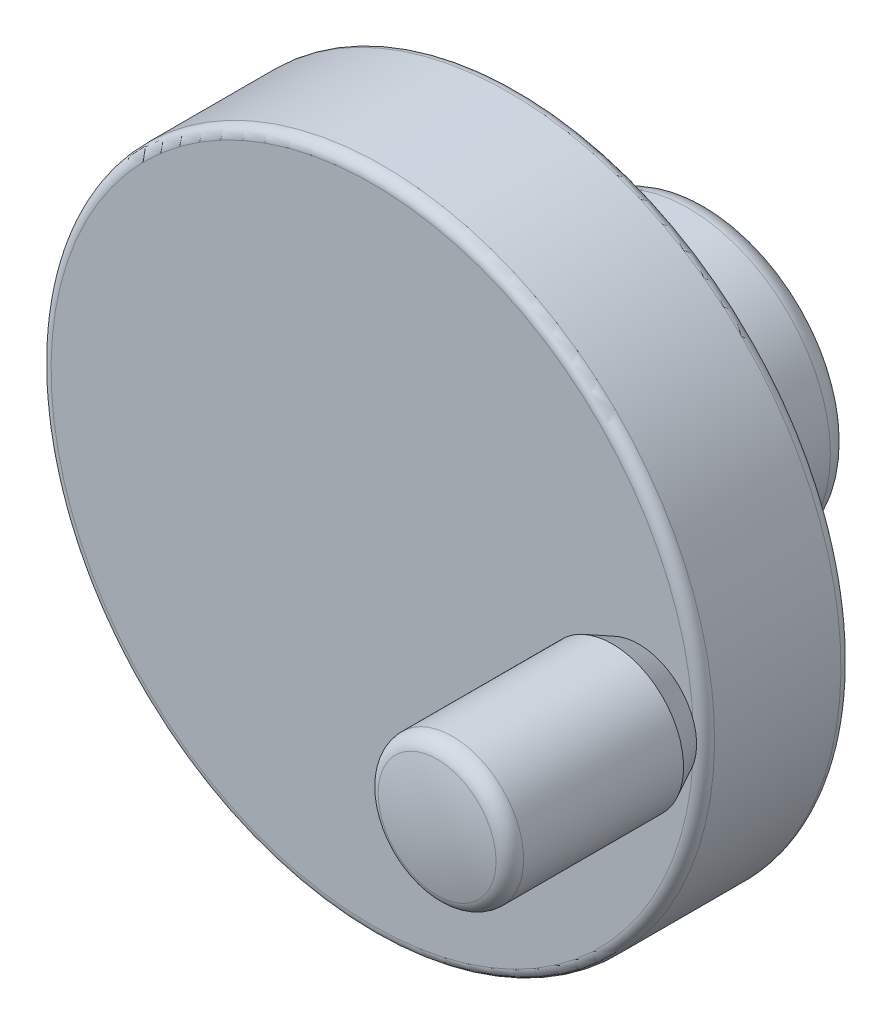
ISO-10303-21;
HEADER;
FILE_DESCRIPTION(('STEP AP214'),'2;1');
FILE_NAME('part.step','',(''),(''),'','','');
FILE_SCHEMA(('AUTOMOTIVE_DESIGN { 1 0 10303 214 1 1 1 1 }'));
ENDSEC;
DATA;
#1=APPLICATION_CONTEXT('core data for automotive mechanical design processes');
#2=APPLICATION_PROTOCOL_DEFINITION('international standard','automotive_design',2000,#1);
#3=PRODUCT_CONTEXT('',#1,'mechanical');
#4=PRODUCT('Part','Part','',(#3));
#5=PRODUCT_RELATED_PRODUCT_CATEGORY('part','',(#4));
#6=PRODUCT_DEFINITION_FORMATION('','',#4);
#7=PRODUCT_DEFINITION_CONTEXT('part definition',#1,'design');
#8=PRODUCT_DEFINITION('design','',#6,#7);
#9=PRODUCT_DEFINITION_SHAPE('','',#8);
#10=(LENGTH_UNIT() NAMED_UNIT(*) SI_UNIT(.MILLI.,.METRE.));
#11=(NAMED_UNIT(*) PLANE_ANGLE_UNIT() SI_UNIT($,.RADIAN.));
#12=(NAMED_UNIT(*) SI_UNIT($,.STERADIAN.) SOLID_ANGLE_UNIT());
#13=UNCERTAINTY_MEASURE_WITH_UNIT(LENGTH_MEASURE(1.E-05),#10,'distance_accuracy_value','');
#14=(GEOMETRIC_REPRESENTATION_CONTEXT(3) GLOBAL_UNCERTAINTY_ASSIGNED_CONTEXT((#13)) GLOBAL_UNIT_ASSIGNED_CONTEXT((#10,
#11,#12)) REPRESENTATION_CONTEXT('',''));
#15=CARTESIAN_POINT('',(0.,0.,0.));
#16=DIRECTION('',(0.,0.,1.));
#17=DIRECTION('',(1.,0.,0.));
#18=AXIS2_PLACEMENT_3D('',#15,#16,#17);
#19=CARTESIAN_POINT('',(-2.5,0.,0.));
#20=DIRECTION('',(0.,0.,1.));
#21=DIRECTION('',(0.,-1.,0.));
#22=AXIS2_PLACEMENT_3D('',#19,#20,#21);
#23=PLANE('',#22);
#24=CARTESIAN_POINT('',(0.,0.,0.));
#25=DIRECTION('',(0.,0.,1.));
#26=DIRECTION('',(0.,-1.,0.));
#27=AXIS2_PLACEMENT_3D('',#24,#25,#26);
#28=CIRCLE('',#27,11.5);
#29=CARTESIAN_POINT('',(0.,-11.5,0.));
#30=VERTEX_POINT('',#29);
#31=EDGE_CURVE('E46',#30,#30,#28,.T.);
#32=ORIENTED_EDGE('',*,*,#31,.F.);
#33=EDGE_LOOP('',(#32));
#34=FACE_BOUND('',#33,.T.);
#35=CARTESIAN_POINT('',(0.,0.,0.));
#36=DIRECTION('',(0.,0.,1.));
#37=DIRECTION('',(0.,-1.,0.));
#38=AXIS2_PLACEMENT_3D('',#35,#36,#37);
#39=CIRCLE('',#38,2.5);
#40=CARTESIAN_POINT('',(0.,-2.50000000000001,0.));
#41=VERTEX_POINT('',#40);
#42=EDGE_CURVE('E18',#41,#41,#39,.T.);
#43=ORIENTED_EDGE('',*,*,#42,.T.);
#44=EDGE_LOOP('',(#43));
#45=FACE_BOUND('',#44,.T.);
#46=ADVANCED_FACE('F12',(#34,#45),#23,.F.);
#47=CARTESIAN_POINT('',(0.,0.,37.));
#48=DIRECTION('',(0.,0.,1.));
#49=DIRECTION('',(0.,-1.,0.));
#50=AXIS2_PLACEMENT_3D('',#47,#48,#49);
#51=CYLINDRICAL_SURFACE('',#50,2.5);
#52=ORIENTED_EDGE('',*,*,#42,.F.);
#53=EDGE_LOOP('',(#52));
#54=FACE_BOUND('',#53,.T.);
#55=CARTESIAN_POINT('',(0.,0.,15.));
#56=DIRECTION('',(0.,0.,-1.));
#57=DIRECTION('',(0.,1.,0.));
#58=AXIS2_PLACEMENT_3D('',#55,#56,#57);
#59=CIRCLE('',#58,2.5);
#60=CARTESIAN_POINT('',(0.,2.5,15.));
#61=VERTEX_POINT('',#60);
#62=EDGE_CURVE('E64',#61,#61,#59,.T.);
#63=ORIENTED_EDGE('',*,*,#62,.F.);
#64=EDGE_LOOP('',(#63));
#65=FACE_BOUND('',#64,.T.);
#66=ADVANCED_FACE('F70',(#54,#65),#51,.F.);
#67=CARTESIAN_POINT('',(0.,0.,32.));
#68=DIRECTION('',(0.,0.,1.));
#69=DIRECTION('',(0.,-1.,0.));
#70=AXIS2_PLACEMENT_3D('',#67,#68,#69);
#71=PLANE('',#70);
#72=CARTESIAN_POINT('',(25.5,0.,32.));
#73=DIRECTION('',(0.,0.,1.));
#74=DIRECTION('',(0.,-1.,0.));
#75=AXIS2_PLACEMENT_3D('',#72,#73,#74);
#76=CIRCLE('',#75,3.99999999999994);
#77=CARTESIAN_POINT('',(25.5,-3.99999999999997,32.));
#78=VERTEX_POINT('',#77);
#79=EDGE_CURVE('E8',#78,#78,#76,.T.);
#80=ORIENTED_EDGE('',*,*,#79,.F.);
#81=EDGE_LOOP('',(#80));
#82=FACE_BOUND('',#81,.T.);
#83=CARTESIAN_POINT('',(0.,0.,32.));
#84=DIRECTION('',(0.,0.,1.));
#85=DIRECTION('',(0.,-1.,0.));
#86=AXIS2_PLACEMENT_3D('',#83,#84,#85);
#87=CIRCLE('',#86,30.5);
#88=CARTESIAN_POINT('',(0.,-30.5,32.));
#89=VERTEX_POINT('',#88);
#90=EDGE_CURVE('E22',#89,#89,#87,.T.);
#91=ORIENTED_EDGE('',*,*,#90,.T.);
#92=EDGE_LOOP('',(#91));
#93=FACE_BOUND('',#92,.T.);
#94=ADVANCED_FACE('F72',(#82,#93),#71,.T.);
#95=CARTESIAN_POINT('',(0.,0.,31.));
#96=DIRECTION('',(0.,0.,1.));
#97=DIRECTION('',(0.,-1.,0.));
#98=AXIS2_PLACEMENT_3D('',#95,#96,#97);
#99=TOROIDAL_SURFACE('',#98,30.5,1.);
#100=CARTESIAN_POINT('',(0.,0.,31.));
#101=DIRECTION('',(0.,0.,1.));
#102=DIRECTION('',(0.,-1.,0.));
#103=AXIS2_PLACEMENT_3D('',#100,#101,#102);
#104=CIRCLE('',#103,31.5);
#105=CARTESIAN_POINT('',(0.,-31.5,31.));
#106=VERTEX_POINT('',#105);
#107=EDGE_CURVE('E26',#106,#106,#104,.T.);
#108=ORIENTED_EDGE('',*,*,#107,.T.);
#109=EDGE_LOOP('',(#108));
#110=FACE_BOUND('',#109,.T.);
#111=ORIENTED_EDGE('',*,*,#90,.F.);
#112=EDGE_LOOP('',(#111));
#113=FACE_BOUND('',#112,.T.);
#114=ADVANCED_FACE('F79',(#110,#113),#99,.T.);
#115=CARTESIAN_POINT('',(0.,0.,37.));
#116=DIRECTION('',(0.,0.,1.));
#117=DIRECTION('',(0.,-1.,0.));
#118=AXIS2_PLACEMENT_3D('',#115,#116,#117);
#119=CYLINDRICAL_SURFACE('',#118,31.5);
#120=CARTESIAN_POINT('',(0.,0.,19.));
#121=DIRECTION('',(0.,0.,1.));
#122=DIRECTION('',(0.,-1.,0.));
#123=AXIS2_PLACEMENT_3D('',#120,#121,#122);
#124=CIRCLE('',#123,31.5);
#125=CARTESIAN_POINT('',(0.,-31.5,19.));
#126=VERTEX_POINT('',#125);
#127=EDGE_CURVE('E31',#126,#126,#124,.T.);
#128=ORIENTED_EDGE('',*,*,#127,.T.);
#129=EDGE_LOOP('',(#128));
#130=FACE_BOUND('',#129,.T.);
#131=ORIENTED_EDGE('',*,*,#107,.F.);
#132=EDGE_LOOP('',(#131));
#133=FACE_BOUND('',#132,.T.);
#134=ADVANCED_FACE('F86',(#130,#133),#119,.T.);
#135=CARTESIAN_POINT('',(0.,0.,19.));
#136=DIRECTION('',(0.,0.,1.));
#137=DIRECTION('',(0.,-1.,0.));
#138=AXIS2_PLACEMENT_3D('',#135,#136,#137);
#139=TOROIDAL_SURFACE('',#138,30.5,1.);
#140=CARTESIAN_POINT('',(0.,0.,18.));
#141=DIRECTION('',(0.,0.,1.));
#142=DIRECTION('',(0.,-1.,0.));
#143=AXIS2_PLACEMENT_3D('',#140,#141,#142);
#144=CIRCLE('',#143,30.5);
#145=CARTESIAN_POINT('',(0.,-30.5,18.));
#146=VERTEX_POINT('',#145);
#147=EDGE_CURVE('E34',#146,#146,#144,.T.);
#148=ORIENTED_EDGE('',*,*,#147,.T.);
#149=EDGE_LOOP('',(#148));
#150=FACE_BOUND('',#149,.T.);
#151=ORIENTED_EDGE('',*,*,#127,.F.);
#152=EDGE_LOOP('',(#151));
#153=FACE_BOUND('',#152,.T.);
#154=ADVANCED_FACE('F90',(#150,#153),#139,.T.);
#155=CARTESIAN_POINT('',(-16.5,0.,18.));
#156=DIRECTION('',(0.,0.,1.));
#157=DIRECTION('',(0.,-1.,0.));
#158=AXIS2_PLACEMENT_3D('',#155,#156,#157);
#159=PLANE('',#158);
#160=ORIENTED_EDGE('',*,*,#147,.F.);
#161=EDGE_LOOP('',(#160));
#162=FACE_BOUND('',#161,.T.);
#163=CARTESIAN_POINT('',(0.,0.,18.));
#164=DIRECTION('',(0.,0.,1.));
#165=DIRECTION('',(0.,-1.,0.));
#166=AXIS2_PLACEMENT_3D('',#163,#164,#165);
#167=CIRCLE('',#166,16.5);
#168=CARTESIAN_POINT('',(0.,-16.5,18.));
#169=VERTEX_POINT('',#168);
#170=EDGE_CURVE('E37',#169,#169,#167,.T.);
#171=ORIENTED_EDGE('',*,*,#170,.T.);
#172=EDGE_LOOP('',(#171));
#173=FACE_BOUND('',#172,.T.);
#174=ADVANCED_FACE('F94',(#162,#173),#159,.F.);
#175=CARTESIAN_POINT('',(0.,0.,15.));
#176=DIRECTION('',(0.,0.,1.));
#177=DIRECTION('',(0.,-1.,0.));
#178=AXIS2_PLACEMENT_3D('',#175,#176,#177);
#179=TOROIDAL_SURFACE('',#178,16.5,3.);
#180=ORIENTED_EDGE('',*,*,#170,.F.);
#181=EDGE_LOOP('',(#180));
#182=FACE_BOUND('',#181,.T.);
#183=CARTESIAN_POINT('',(0.,0.,15.));
#184=DIRECTION('',(0.,0.,1.));
#185=DIRECTION('',(0.,-1.,0.));
#186=AXIS2_PLACEMENT_3D('',#183,#184,#185);
#187=CIRCLE('',#186,13.5);
#188=CARTESIAN_POINT('',(0.,-13.5,15.));
#189=VERTEX_POINT('',#188);
#190=EDGE_CURVE('E40',#189,#189,#187,.T.);
#191=ORIENTED_EDGE('',*,*,#190,.T.);
#192=EDGE_LOOP('',(#191));
#193=FACE_BOUND('',#192,.T.);
#194=ADVANCED_FACE('F98',(#182,#193),#179,.F.);
#195=CARTESIAN_POINT('',(0.,0.,37.));
#196=DIRECTION('',(0.,0.,1.));
#197=DIRECTION('',(0.,-1.,0.));
#198=AXIS2_PLACEMENT_3D('',#195,#196,#197);
#199=CYLINDRICAL_SURFACE('',#198,13.5);
#200=CARTESIAN_POINT('',(0.,0.,2.));
#201=DIRECTION('',(0.,0.,1.));
#202=DIRECTION('',(0.,-1.,0.));
#203=AXIS2_PLACEMENT_3D('',#200,#201,#202);
#204=CIRCLE('',#203,13.5);
#205=CARTESIAN_POINT('',(0.,-13.5,2.));
#206=VERTEX_POINT('',#205);
#207=EDGE_CURVE('E43',#206,#206,#204,.T.);
#208=ORIENTED_EDGE('',*,*,#207,.T.);
#209=EDGE_LOOP('',(#208));
#210=FACE_BOUND('',#209,.T.);
#211=ORIENTED_EDGE('',*,*,#190,.F.);
#212=EDGE_LOOP('',(#211));
#213=FACE_BOUND('',#212,.T.);
#214=ADVANCED_FACE('F102',(#210,#213),#199,.T.);
#215=CARTESIAN_POINT('',(0.,0.,2.));
#216=DIRECTION('',(0.,0.,1.));
#217=DIRECTION('',(0.,-1.,0.));
#218=AXIS2_PLACEMENT_3D('',#215,#216,#217);
#219=TOROIDAL_SURFACE('',#218,11.5,2.);
#220=ORIENTED_EDGE('',*,*,#31,.T.);
#221=EDGE_LOOP('',(#220));
#222=FACE_BOUND('',#221,.T.);
#223=ORIENTED_EDGE('',*,*,#207,.F.);
#224=EDGE_LOOP('',(#223));
#225=FACE_BOUND('',#224,.T.);
#226=ADVANCED_FACE('F106',(#222,#225),#219,.T.);
#227=CARTESIAN_POINT('',(25.5,0.,27.6000000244));
#228=DIRECTION('',(0.,1.,0.));
#229=DIRECTION('',(0.,0.,1.));
#230=AXIS2_PLACEMENT_3D('',#227,#228,#229);
#231=SPHERICAL_SURFACE('',#230,24.3999999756);
#232=CARTESIAN_POINT('',(25.5,0.,27.6000000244));
#233=DIRECTION('',(0.,0.,-1.));
#234=DIRECTION('',(-1.,0.,0.));
#235=AXIS2_PLACEMENT_3D('',#232,#233,#234);
#236=SPHERICAL_SURFACE('',#235,24.3999999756);
#237=CARTESIAN_POINT('',(25.5,0.,51.349121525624));
#238=DIRECTION('',(0.,0.,-1.));
#239=DIRECTION('',(-1.,0.,0.));
#240=AXIS2_PLACEMENT_3D('',#237,#238,#239);
#241=CIRCLE('',#240,5.59814493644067);
#242=CARTESIAN_POINT('',(19.9018550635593,0.,51.349121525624));
#243=VERTEX_POINT('',#242);
#244=EDGE_CURVE('E49',#243,#243,#241,.T.);
#245=ORIENTED_EDGE('',*,*,#244,.F.);
#246=EDGE_LOOP('',(#245));
#247=FACE_BOUND('',#246,.T.);
#248=ADVANCED_FACE('F110',(#247),#236,.T.);
#249=CARTESIAN_POINT('',(25.5,0.,49.8891345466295));
#250=DIRECTION('',(0.,0.,-1.));
#251=DIRECTION('',(-1.,0.,0.));
#252=AXIS2_PLACEMENT_3D('',#249,#250,#251);
#253=TOROIDAL_SURFACE('',#252,5.25399668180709,1.50000000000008);
#254=CARTESIAN_POINT('',(25.5,0.,49.8891345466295));
#255=DIRECTION('',(0.,0.,-1.));
#256=DIRECTION('',(-1.,0.,0.));
#257=AXIS2_PLACEMENT_3D('',#254,#255,#256);
#258=CIRCLE('',#257,6.75399668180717);
#259=CARTESIAN_POINT('',(18.7460033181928,0.,49.8891345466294));
#260=VERTEX_POINT('',#259);
#261=EDGE_CURVE('E52',#260,#260,#258,.T.);
#262=ORIENTED_EDGE('',*,*,#261,.F.);
#263=EDGE_LOOP('',(#262));
#264=FACE_BOUND('',#263,.T.);
#265=ORIENTED_EDGE('',*,*,#244,.T.);
#266=EDGE_LOOP('',(#265));
#267=FACE_BOUND('',#266,.T.);
#268=ADVANCED_FACE('F114',(#264,#267),#253,.T.);
#269=CARTESIAN_POINT('',(25.5,0.,20.9654943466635));
#270=DIRECTION('',(0.,0.,-1.));
#271=DIRECTION('',(-1.,0.,0.));
#272=AXIS2_PLACEMENT_3D('',#269,#270,#271);
#273=CYLINDRICAL_SURFACE('',#272,6.75399668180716);
#274=CARTESIAN_POINT('',(25.5,0.,34.700000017));
#275=DIRECTION('',(0.,0.,-1.));
#276=DIRECTION('',(-1.,0.,0.));
#277=AXIS2_PLACEMENT_3D('',#274,#275,#276);
#278=CIRCLE('',#277,6.75399668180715);
#279=CARTESIAN_POINT('',(18.7460033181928,0.,34.700000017));
#280=VERTEX_POINT('',#279);
#281=EDGE_CURVE('E55',#280,#280,#278,.T.);
#282=ORIENTED_EDGE('',*,*,#281,.F.);
#283=EDGE_LOOP('',(#282));
#284=FACE_BOUND('',#283,.T.);
#285=ORIENTED_EDGE('',*,*,#261,.T.);
#286=EDGE_LOOP('',(#285));
#287=FACE_BOUND('',#286,.T.);
#288=ADVANCED_FACE('F118',(#284,#287),#273,.T.);
#289=CARTESIAN_POINT('',(25.5,0.,32.2));
#290=DIRECTION('',(0.,0.,1.));
#291=DIRECTION('',(1.,0.,0.));
#292=AXIS2_PLACEMENT_3D('',#289,#290,#291);
#293=CONICAL_SURFACE('',#292,5.49515095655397,0.466474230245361);
#294=ORIENTED_EDGE('',*,*,#281,.T.);
#295=EDGE_LOOP('',(#294));
#296=FACE_BOUND('',#295,.T.);
#297=CARTESIAN_POINT('',(25.5,0.,32.2));
#298=DIRECTION('',(0.,0.,-1.));
#299=DIRECTION('',(-1.,0.,0.));
#300=AXIS2_PLACEMENT_3D('',#297,#298,#299);
#301=CIRCLE('',#300,5.49515095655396);
#302=CARTESIAN_POINT('',(20.004849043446,0.,32.2));
#303=VERTEX_POINT('',#302);
#304=EDGE_CURVE('E58',#303,#303,#301,.T.);
#305=ORIENTED_EDGE('',*,*,#304,.F.);
#306=EDGE_LOOP('',(#305));
#307=FACE_BOUND('',#306,.T.);
#308=ADVANCED_FACE('F122',(#296,#307),#293,.T.);
#309=CARTESIAN_POINT('',(30.995150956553,0.,32.2));
#310=DIRECTION('',(0.,0.,1.));
#311=DIRECTION('',(1.,0.,0.));
#312=AXIS2_PLACEMENT_3D('',#309,#310,#311);
#313=PLANE('',#312);
#314=CARTESIAN_POINT('',(25.5,0.,32.2));
#315=DIRECTION('',(0.,0.,-1.));
#316=DIRECTION('',(-1.,0.,0.));
#317=AXIS2_PLACEMENT_3D('',#314,#315,#316);
#318=CIRCLE('',#317,3.99999999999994);
#319=CARTESIAN_POINT('',(21.5000000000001,0.,32.2));
#320=VERTEX_POINT('',#319);
#321=EDGE_CURVE('E61',#320,#320,#318,.T.);
#322=ORIENTED_EDGE('',*,*,#321,.F.);
#323=EDGE_LOOP('',(#322));
#324=FACE_BOUND('',#323,.T.);
#325=ORIENTED_EDGE('',*,*,#304,.T.);
#326=EDGE_LOOP('',(#325));
#327=FACE_BOUND('',#326,.T.);
#328=ADVANCED_FACE('F126',(#324,#327),#313,.F.);
#329=CARTESIAN_POINT('',(25.5,0.,20.9654943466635));
#330=DIRECTION('',(0.,0.,-1.));
#331=DIRECTION('',(-1.,0.,0.));
#332=AXIS2_PLACEMENT_3D('',#329,#330,#331);
#333=CYLINDRICAL_SURFACE('',#332,3.99999999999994);
#334=ORIENTED_EDGE('',*,*,#321,.T.);
#335=EDGE_LOOP('',(#334));
#336=FACE_BOUND('',#335,.T.);
#337=ORIENTED_EDGE('',*,*,#79,.T.);
#338=EDGE_LOOP('',(#337));
#339=FACE_BOUND('',#338,.T.);
#340=ADVANCED_FACE('F130',(#336,#339),#333,.T.);
#341=CARTESIAN_POINT('',(0.,0.,15.));
#342=DIRECTION('',(0.,0.,-1.));
#343=DIRECTION('',(0.,1.,0.));
#344=AXIS2_PLACEMENT_3D('',#341,#342,#343);
#345=PLANE('',#344);
#346=ORIENTED_EDGE('',*,*,#62,.T.);
#347=EDGE_LOOP('',(#346));
#348=FACE_BOUND('',#347,.T.);
#349=ADVANCED_FACE('F68',(#348),#345,.T.);
#350=CLOSED_SHELL('',(#46,#66,#94,#114,#134,#154,#174,#194,#214,#226,#248,#268,#288,#308,#328,
#340,#349));
#351=MANIFOLD_SOLID_BREP('B1',#350);
#352=ADVANCED_BREP_SHAPE_REPRESENTATION('',(#18,#351),#14);
#353=SHAPE_DEFINITION_REPRESENTATION(#9,#352);
ENDSEC;
END-ISO-10303-21;
